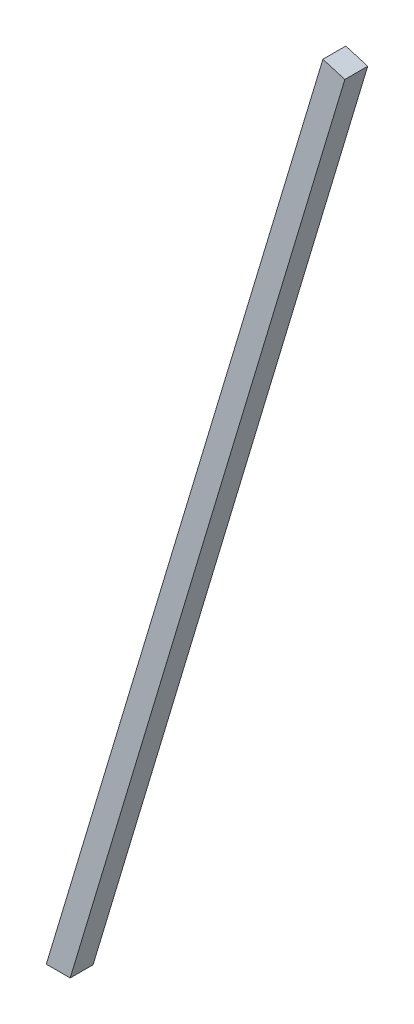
ISO-10303-21;
HEADER;
FILE_DESCRIPTION(('STEP AP214'),'2;1');
FILE_NAME('part.step','',(''),(''),'','','');
FILE_SCHEMA(('AUTOMOTIVE_DESIGN { 1 0 10303 214 1 1 1 1 }'));
ENDSEC;
DATA;
#1=APPLICATION_CONTEXT('core data for automotive mechanical design processes');
#2=APPLICATION_PROTOCOL_DEFINITION('international standard','automotive_design',2000,#1);
#3=PRODUCT_CONTEXT('',#1,'mechanical');
#4=PRODUCT('Part','Part','',(#3));
#5=PRODUCT_RELATED_PRODUCT_CATEGORY('part','',(#4));
#6=PRODUCT_DEFINITION_FORMATION('','',#4);
#7=PRODUCT_DEFINITION_CONTEXT('part definition',#1,'design');
#8=PRODUCT_DEFINITION('design','',#6,#7);
#9=PRODUCT_DEFINITION_SHAPE('','',#8);
#10=(LENGTH_UNIT() NAMED_UNIT(*) SI_UNIT(.MILLI.,.METRE.));
#11=(NAMED_UNIT(*) PLANE_ANGLE_UNIT() SI_UNIT($,.RADIAN.));
#12=(NAMED_UNIT(*) SI_UNIT($,.STERADIAN.) SOLID_ANGLE_UNIT());
#13=UNCERTAINTY_MEASURE_WITH_UNIT(LENGTH_MEASURE(1.E-05),#10,'distance_accuracy_value','');
#14=(GEOMETRIC_REPRESENTATION_CONTEXT(3) GLOBAL_UNCERTAINTY_ASSIGNED_CONTEXT((#13)) GLOBAL_UNIT_ASSIGNED_CONTEXT((#10,
#11,#12)) REPRESENTATION_CONTEXT('',''));
#15=CARTESIAN_POINT('',(0.,0.,0.));
#16=DIRECTION('',(0.,0.,1.));
#17=DIRECTION('',(1.,0.,0.));
#18=AXIS2_PLACEMENT_3D('',#15,#16,#17);
#19=CARTESIAN_POINT('',(120.,400.,10.));
#20=DIRECTION('',(-0.957826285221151,0.287347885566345,0.));
#21=DIRECTION('',(-0.287347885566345,-0.957826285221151,0.));
#22=AXIS2_PLACEMENT_3D('',#19,#20,#21);
#23=PLANE('',#22);
#24=DIRECTION('',(0.287347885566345,0.957826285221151,0.));
#25=VECTOR('',#24,1.);
#26=CARTESIAN_POINT('',(120.,400.,0.));
#27=LINE('',#26,#25);
#28=CARTESIAN_POINT('',(0.,0.,0.));
#29=VERTEX_POINT('',#28);
#30=CARTESIAN_POINT('',(120.,400.,0.));
#31=VERTEX_POINT('',#30);
#32=EDGE_CURVE('E75',#29,#31,#27,.T.);
#33=ORIENTED_EDGE('',*,*,#32,.T.);
#34=DIRECTION('',(0.,0.,-1.));
#35=VECTOR('',#34,1.);
#36=CARTESIAN_POINT('',(120.,400.,10.));
#37=LINE('',#36,#35);
#38=CARTESIAN_POINT('',(120.,400.,10.));
#39=VERTEX_POINT('',#38);
#40=EDGE_CURVE('E11',#39,#31,#37,.T.);
#41=ORIENTED_EDGE('',*,*,#40,.F.);
#42=DIRECTION('',(0.287347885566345,0.957826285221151,0.));
#43=VECTOR('',#42,1.);
#44=CARTESIAN_POINT('',(120.,400.,10.));
#45=LINE('',#44,#43);
#46=CARTESIAN_POINT('',(0.,0.,10.));
#47=VERTEX_POINT('',#46);
#48=EDGE_CURVE('E93',#47,#39,#45,.T.);
#49=ORIENTED_EDGE('',*,*,#48,.F.);
#50=DIRECTION('',(0.,0.,-1.));
#51=VECTOR('',#50,1.);
#52=CARTESIAN_POINT('',(0.,0.,10.));
#53=LINE('',#52,#51);
#54=EDGE_CURVE('E87',#47,#29,#53,.T.);
#55=ORIENTED_EDGE('',*,*,#54,.T.);
#56=EDGE_LOOP('',(#33,#41,#49,#55));
#57=FACE_BOUND('',#56,.T.);
#58=ADVANCED_FACE('F31',(#57),#23,.F.);
#59=CARTESIAN_POINT('',(110.421737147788,402.873478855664,10.));
#60=DIRECTION('',(-0.287347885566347,-0.957826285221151,0.));
#61=DIRECTION('',(0.957826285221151,-0.287347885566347,0.));
#62=AXIS2_PLACEMENT_3D('',#59,#60,#61);
#63=PLANE('',#62);
#64=DIRECTION('',(-0.957826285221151,0.287347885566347,0.));
#65=VECTOR('',#64,1.);
#66=CARTESIAN_POINT('',(110.421737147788,402.873478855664,0.));
#67=LINE('',#66,#65);
#68=CARTESIAN_POINT('',(110.421737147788,402.873478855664,0.));
#69=VERTEX_POINT('',#68);
#70=EDGE_CURVE('E71',#31,#69,#67,.T.);
#71=ORIENTED_EDGE('',*,*,#70,.T.);
#72=DIRECTION('',(0.,0.,-1.));
#73=VECTOR('',#72,1.);
#74=CARTESIAN_POINT('',(110.421737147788,402.873478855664,10.));
#75=LINE('',#74,#73);
#76=CARTESIAN_POINT('',(110.421737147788,402.873478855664,10.));
#77=VERTEX_POINT('',#76);
#78=EDGE_CURVE('E38',#77,#69,#75,.T.);
#79=ORIENTED_EDGE('',*,*,#78,.F.);
#80=DIRECTION('',(-0.957826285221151,0.287347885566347,0.));
#81=VECTOR('',#80,1.);
#82=CARTESIAN_POINT('',(110.421737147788,402.873478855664,10.));
#83=LINE('',#82,#81);
#84=EDGE_CURVE('E83',#39,#77,#83,.T.);
#85=ORIENTED_EDGE('',*,*,#84,.F.);
#86=ORIENTED_EDGE('',*,*,#40,.T.);
#87=EDGE_LOOP('',(#71,#79,#85,#86));
#88=FACE_BOUND('',#87,.T.);
#89=ADVANCED_FACE('F82',(#88),#63,.F.);
#90=CARTESIAN_POINT('',(-10.4403065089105,0.,10.));
#91=DIRECTION('',(0.957826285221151,-0.287347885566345,0.));
#92=DIRECTION('',(0.287347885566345,0.957826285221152,0.));
#93=AXIS2_PLACEMENT_3D('',#90,#91,#92);
#94=PLANE('',#93);
#95=DIRECTION('',(-0.287347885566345,-0.957826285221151,0.));
#96=VECTOR('',#95,1.);
#97=CARTESIAN_POINT('',(-10.4403065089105,0.,0.));
#98=LINE('',#97,#96);
#99=CARTESIAN_POINT('',(-10.4403065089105,0.,0.));
#100=VERTEX_POINT('',#99);
#101=EDGE_CURVE('E76',#69,#100,#98,.T.);
#102=ORIENTED_EDGE('',*,*,#101,.T.);
#103=DIRECTION('',(0.,0.,-1.));
#104=VECTOR('',#103,1.);
#105=CARTESIAN_POINT('',(-10.4403065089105,0.,10.));
#106=LINE('',#105,#104);
#107=CARTESIAN_POINT('',(-10.4403065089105,0.,10.));
#108=VERTEX_POINT('',#107);
#109=EDGE_CURVE('E99',#108,#100,#106,.T.);
#110=ORIENTED_EDGE('',*,*,#109,.F.);
#111=DIRECTION('',(-0.287347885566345,-0.957826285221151,0.));
#112=VECTOR('',#111,1.);
#113=CARTESIAN_POINT('',(-10.4403065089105,0.,10.));
#114=LINE('',#113,#112);
#115=EDGE_CURVE('E50',#77,#108,#114,.T.);
#116=ORIENTED_EDGE('',*,*,#115,.F.);
#117=ORIENTED_EDGE('',*,*,#78,.T.);
#118=EDGE_LOOP('',(#102,#110,#116,#117));
#119=FACE_BOUND('',#118,.T.);
#120=ADVANCED_FACE('F102',(#119),#94,.F.);
#121=CARTESIAN_POINT('',(0.,0.,10.));
#122=DIRECTION('',(0.,1.,0.));
#123=DIRECTION('',(-1.,0.,0.));
#124=AXIS2_PLACEMENT_3D('',#121,#122,#123);
#125=PLANE('',#124);
#126=DIRECTION('',(1.,0.,0.));
#127=VECTOR('',#126,1.);
#128=CARTESIAN_POINT('',(0.,0.,0.));
#129=LINE('',#128,#127);
#130=EDGE_CURVE('E91',#100,#29,#129,.T.);
#131=ORIENTED_EDGE('',*,*,#130,.T.);
#132=ORIENTED_EDGE('',*,*,#54,.F.);
#133=DIRECTION('',(1.,0.,0.));
#134=VECTOR('',#133,1.);
#135=CARTESIAN_POINT('',(0.,0.,10.));
#136=LINE('',#135,#134);
#137=EDGE_CURVE('E45',#108,#47,#136,.T.);
#138=ORIENTED_EDGE('',*,*,#137,.F.);
#139=ORIENTED_EDGE('',*,*,#109,.T.);
#140=EDGE_LOOP('',(#131,#132,#138,#139));
#141=FACE_BOUND('',#140,.T.);
#142=ADVANCED_FACE('F104',(#141),#125,.F.);
#143=CARTESIAN_POINT('',(120.,400.,10.));
#144=DIRECTION('',(0.,0.,1.));
#145=DIRECTION('',(1.,0.,0.));
#146=AXIS2_PLACEMENT_3D('',#143,#144,#145);
#147=PLANE('',#146);
#148=ORIENTED_EDGE('',*,*,#48,.T.);
#149=ORIENTED_EDGE('',*,*,#84,.T.);
#150=ORIENTED_EDGE('',*,*,#115,.T.);
#151=ORIENTED_EDGE('',*,*,#137,.T.);
#152=EDGE_LOOP('',(#148,#149,#150,#151));
#153=FACE_BOUND('',#152,.T.);
#154=ADVANCED_FACE('F105',(#153),#147,.T.);
#155=CARTESIAN_POINT('',(120.,400.,0.));
#156=DIRECTION('',(0.,0.,1.));
#157=DIRECTION('',(1.,0.,0.));
#158=AXIS2_PLACEMENT_3D('',#155,#156,#157);
#159=PLANE('',#158);
#160=ORIENTED_EDGE('',*,*,#32,.F.);
#161=ORIENTED_EDGE('',*,*,#130,.F.);
#162=ORIENTED_EDGE('',*,*,#101,.F.);
#163=ORIENTED_EDGE('',*,*,#70,.F.);
#164=EDGE_LOOP('',(#160,#161,#162,#163));
#165=FACE_BOUND('',#164,.T.);
#166=ADVANCED_FACE('F72',(#165),#159,.F.);
#167=CLOSED_SHELL('',(#58,#89,#120,#142,#154,#166));
#168=MANIFOLD_SOLID_BREP('B2',#167);
#169=ADVANCED_BREP_SHAPE_REPRESENTATION('',(#18,#168),#14);
#170=SHAPE_DEFINITION_REPRESENTATION(#9,#169);
ENDSEC;
END-ISO-10303-21;
